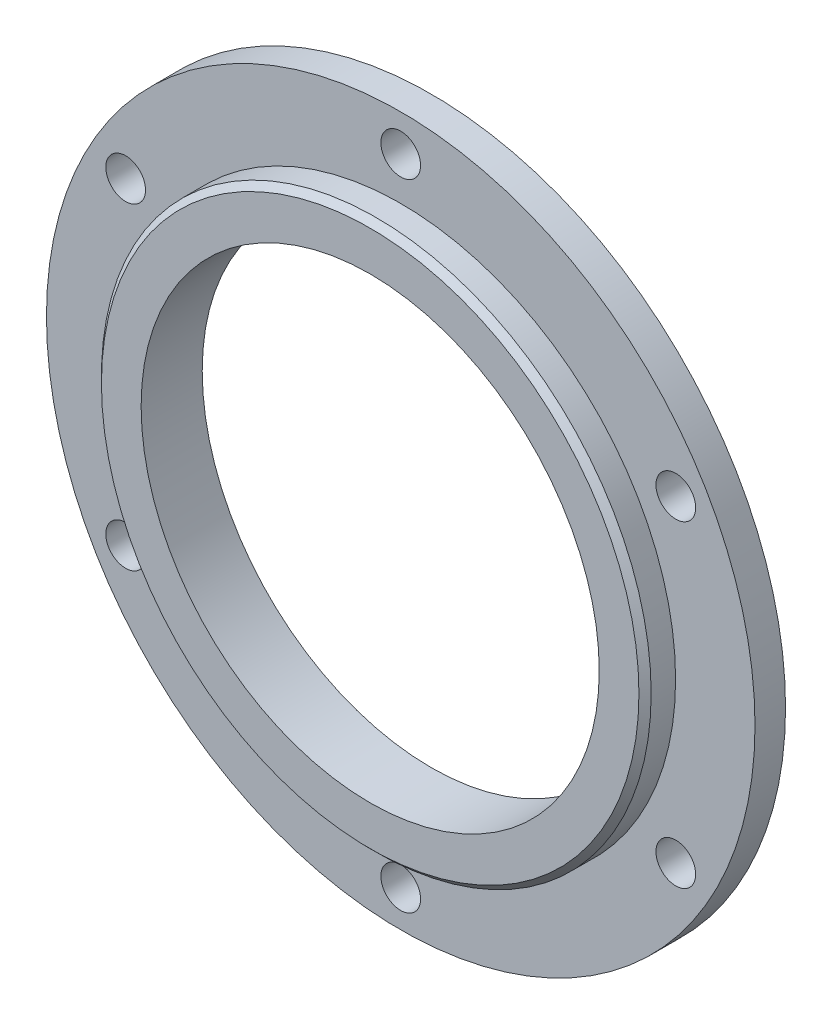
ISO-10303-21;
HEADER;
FILE_DESCRIPTION(('STEP AP214'),'2;1');
FILE_NAME('part.step','',(''),(''),'','','');
FILE_SCHEMA(('AUTOMOTIVE_DESIGN { 1 0 10303 214 1 1 1 1 }'));
ENDSEC;
DATA;
#1=APPLICATION_CONTEXT('core data for automotive mechanical design processes');
#2=APPLICATION_PROTOCOL_DEFINITION('international standard','automotive_design',2000,#1);
#3=PRODUCT_CONTEXT('',#1,'mechanical');
#4=PRODUCT('Part','Part','',(#3));
#5=PRODUCT_RELATED_PRODUCT_CATEGORY('part','',(#4));
#6=PRODUCT_DEFINITION_FORMATION('','',#4);
#7=PRODUCT_DEFINITION_CONTEXT('part definition',#1,'design');
#8=PRODUCT_DEFINITION('design','',#6,#7);
#9=PRODUCT_DEFINITION_SHAPE('','',#8);
#10=(LENGTH_UNIT() NAMED_UNIT(*) SI_UNIT(.MILLI.,.METRE.));
#11=(NAMED_UNIT(*) PLANE_ANGLE_UNIT() SI_UNIT($,.RADIAN.));
#12=(NAMED_UNIT(*) SI_UNIT($,.STERADIAN.) SOLID_ANGLE_UNIT());
#13=UNCERTAINTY_MEASURE_WITH_UNIT(LENGTH_MEASURE(1.E-05),#10,'distance_accuracy_value','');
#14=(GEOMETRIC_REPRESENTATION_CONTEXT(3) GLOBAL_UNCERTAINTY_ASSIGNED_CONTEXT((#13)) GLOBAL_UNIT_ASSIGNED_CONTEXT((#10,
#11,#12)) REPRESENTATION_CONTEXT('',''));
#15=CARTESIAN_POINT('',(0.,0.,0.));
#16=DIRECTION('',(0.,0.,1.));
#17=DIRECTION('',(1.,0.,0.));
#18=AXIS2_PLACEMENT_3D('',#15,#16,#17);
#19=CARTESIAN_POINT('',(0.,45.,-5.));
#20=DIRECTION('',(0.,0.,-1.));
#21=DIRECTION('',(-1.,0.,0.));
#22=AXIS2_PLACEMENT_3D('',#19,#20,#21);
#23=PLANE('',#22);
#24=CARTESIAN_POINT('',(-45.0333209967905,26.0000000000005,-5.));
#25=DIRECTION('',(0.,0.,1.));
#26=DIRECTION('',(1.,0.,0.));
#27=AXIS2_PLACEMENT_3D('',#24,#25,#26);
#28=CIRCLE('',#27,3.25);
#29=CARTESIAN_POINT('',(-41.7833209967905,26.0000000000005,-5.));
#30=VERTEX_POINT('',#29);
#31=EDGE_CURVE('E75',#30,#30,#28,.T.);
#32=ORIENTED_EDGE('',*,*,#31,.F.);
#33=EDGE_LOOP('',(#32));
#34=FACE_BOUND('',#33,.T.);
#35=CARTESIAN_POINT('',(-45.0333209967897,-26.0000000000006,-5.));
#36=DIRECTION('',(0.,0.,1.));
#37=DIRECTION('',(1.,0.,0.));
#38=AXIS2_PLACEMENT_3D('',#35,#36,#37);
#39=CIRCLE('',#38,3.2500000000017);
#40=CARTESIAN_POINT('',(-41.783320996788,-26.0000000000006,-5.));
#41=VERTEX_POINT('',#40);
#42=EDGE_CURVE('E65',#41,#41,#39,.T.);
#43=ORIENTED_EDGE('',*,*,#42,.F.);
#44=EDGE_LOOP('',(#43));
#45=FACE_BOUND('',#44,.T.);
#46=CARTESIAN_POINT('',(1.47114159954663E-12,-52.,-5.));
#47=DIRECTION('',(0.,0.,1.));
#48=DIRECTION('',(1.,0.,0.));
#49=AXIS2_PLACEMENT_3D('',#46,#47,#48);
#50=CIRCLE('',#49,3.25000000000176);
#51=CARTESIAN_POINT('',(3.25000000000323,-52.,-5.));
#52=VERTEX_POINT('',#51);
#53=EDGE_CURVE('E62',#52,#52,#50,.T.);
#54=ORIENTED_EDGE('',*,*,#53,.F.);
#55=EDGE_LOOP('',(#54));
#56=FACE_BOUND('',#55,.T.);
#57=CARTESIAN_POINT('',(45.0333209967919,-25.9999999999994,-5.));
#58=DIRECTION('',(0.,0.,1.));
#59=DIRECTION('',(1.,0.,0.));
#60=AXIS2_PLACEMENT_3D('',#57,#58,#59);
#61=CIRCLE('',#60,3.25000000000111);
#62=CARTESIAN_POINT('',(48.283320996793,-25.9999999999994,-5.));
#63=VERTEX_POINT('',#62);
#64=EDGE_CURVE('E59',#63,#63,#61,.T.);
#65=ORIENTED_EDGE('',*,*,#64,.F.);
#66=EDGE_LOOP('',(#65));
#67=FACE_BOUND('',#66,.T.);
#68=CARTESIAN_POINT('',(45.0333209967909,25.9999999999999,-5.));
#69=DIRECTION('',(0.,0.,1.));
#70=DIRECTION('',(1.,0.,0.));
#71=AXIS2_PLACEMENT_3D('',#68,#69,#70);
#72=CIRCLE('',#71,3.25);
#73=CARTESIAN_POINT('',(48.2833209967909,25.9999999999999,-5.));
#74=VERTEX_POINT('',#73);
#75=EDGE_CURVE('E55',#74,#74,#72,.T.);
#76=ORIENTED_EDGE('',*,*,#75,.F.);
#77=EDGE_LOOP('',(#76));
#78=FACE_BOUND('',#77,.T.);
#79=CARTESIAN_POINT('',(0.,52.,-5.));
#80=DIRECTION('',(0.,0.,1.));
#81=DIRECTION('',(1.,0.,0.));
#82=AXIS2_PLACEMENT_3D('',#79,#80,#81);
#83=CIRCLE('',#82,3.25);
#84=CARTESIAN_POINT('',(3.25,52.,-5.));
#85=VERTEX_POINT('',#84);
#86=EDGE_CURVE('E51',#85,#85,#83,.T.);
#87=ORIENTED_EDGE('',*,*,#86,.F.);
#88=EDGE_LOOP('',(#87));
#89=FACE_BOUND('',#88,.T.);
#90=CARTESIAN_POINT('',(0.,0.,-5.));
#91=DIRECTION('',(0.,0.,1.));
#92=DIRECTION('',(1.,0.,0.));
#93=AXIS2_PLACEMENT_3D('',#90,#91,#92);
#94=CIRCLE('',#93,45.);
#95=CARTESIAN_POINT('',(45.,0.,-5.));
#96=VERTEX_POINT('',#95);
#97=EDGE_CURVE('E50',#96,#96,#94,.T.);
#98=ORIENTED_EDGE('',*,*,#97,.F.);
#99=EDGE_LOOP('',(#98));
#100=FACE_BOUND('',#99,.T.);
#101=CARTESIAN_POINT('',(0.,0.,-5.));
#102=DIRECTION('',(0.,0.,1.));
#103=DIRECTION('',(1.,0.,0.));
#104=AXIS2_PLACEMENT_3D('',#101,#102,#103);
#105=CIRCLE('',#104,58.);
#106=CARTESIAN_POINT('',(58.,0.,-5.));
#107=VERTEX_POINT('',#106);
#108=EDGE_CURVE('E10',#107,#107,#105,.T.);
#109=ORIENTED_EDGE('',*,*,#108,.T.);
#110=EDGE_LOOP('',(#109));
#111=FACE_BOUND('',#110,.T.);
#112=ADVANCED_FACE('F31',(#34,#45,#56,#67,#78,#89,#100,#111),#23,.F.);
#113=CARTESIAN_POINT('',(0.,0.,0.));
#114=DIRECTION('',(0.,0.,1.));
#115=DIRECTION('',(1.,0.,0.));
#116=AXIS2_PLACEMENT_3D('',#113,#114,#115);
#117=CYLINDRICAL_SURFACE('',#116,58.);
#118=ORIENTED_EDGE('',*,*,#108,.F.);
#119=EDGE_LOOP('',(#118));
#120=FACE_BOUND('',#119,.T.);
#121=CARTESIAN_POINT('',(0.,0.,-10.));
#122=DIRECTION('',(0.,0.,1.));
#123=DIRECTION('',(1.,0.,0.));
#124=AXIS2_PLACEMENT_3D('',#121,#122,#123);
#125=CIRCLE('',#124,58.);
#126=CARTESIAN_POINT('',(58.,0.,-10.));
#127=VERTEX_POINT('',#126);
#128=EDGE_CURVE('E38',#127,#127,#125,.T.);
#129=ORIENTED_EDGE('',*,*,#128,.T.);
#130=EDGE_LOOP('',(#129));
#131=FACE_BOUND('',#130,.T.);
#132=ADVANCED_FACE('F125',(#120,#131),#117,.T.);
#133=CARTESIAN_POINT('',(0.,58.,-10.));
#134=DIRECTION('',(0.,0.,1.));
#135=DIRECTION('',(1.,0.,0.));
#136=AXIS2_PLACEMENT_3D('',#133,#134,#135);
#137=PLANE('',#136);
#138=CARTESIAN_POINT('',(-45.0333209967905,26.0000000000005,-10.));
#139=DIRECTION('',(0.,0.,1.));
#140=DIRECTION('',(1.,0.,0.));
#141=AXIS2_PLACEMENT_3D('',#138,#139,#140);
#142=CIRCLE('',#141,3.25);
#143=CARTESIAN_POINT('',(-41.7833209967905,26.0000000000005,-10.));
#144=VERTEX_POINT('',#143);
#145=EDGE_CURVE('E34',#144,#144,#142,.T.);
#146=ORIENTED_EDGE('',*,*,#145,.T.);
#147=EDGE_LOOP('',(#146));
#148=FACE_BOUND('',#147,.T.);
#149=CARTESIAN_POINT('',(-45.0333209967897,-26.0000000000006,-10.));
#150=DIRECTION('',(0.,0.,1.));
#151=DIRECTION('',(1.,0.,0.));
#152=AXIS2_PLACEMENT_3D('',#149,#150,#151);
#153=CIRCLE('',#152,3.2500000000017);
#154=CARTESIAN_POINT('',(-41.783320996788,-26.0000000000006,-10.));
#155=VERTEX_POINT('',#154);
#156=EDGE_CURVE('E63',#155,#155,#153,.T.);
#157=ORIENTED_EDGE('',*,*,#156,.T.);
#158=EDGE_LOOP('',(#157));
#159=FACE_BOUND('',#158,.T.);
#160=CARTESIAN_POINT('',(1.47114159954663E-12,-52.,-10.));
#161=DIRECTION('',(0.,0.,1.));
#162=DIRECTION('',(1.,0.,0.));
#163=AXIS2_PLACEMENT_3D('',#160,#161,#162);
#164=CIRCLE('',#163,3.25000000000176);
#165=CARTESIAN_POINT('',(3.25000000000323,-52.,-10.));
#166=VERTEX_POINT('',#165);
#167=EDGE_CURVE('E60',#166,#166,#164,.T.);
#168=ORIENTED_EDGE('',*,*,#167,.T.);
#169=EDGE_LOOP('',(#168));
#170=FACE_BOUND('',#169,.T.);
#171=CARTESIAN_POINT('',(45.0333209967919,-25.9999999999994,-10.));
#172=DIRECTION('',(0.,0.,1.));
#173=DIRECTION('',(1.,0.,0.));
#174=AXIS2_PLACEMENT_3D('',#171,#172,#173);
#175=CIRCLE('',#174,3.25000000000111);
#176=CARTESIAN_POINT('',(48.283320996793,-25.9999999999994,-10.));
#177=VERTEX_POINT('',#176);
#178=EDGE_CURVE('E56',#177,#177,#175,.T.);
#179=ORIENTED_EDGE('',*,*,#178,.T.);
#180=EDGE_LOOP('',(#179));
#181=FACE_BOUND('',#180,.T.);
#182=CARTESIAN_POINT('',(45.0333209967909,25.9999999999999,-10.));
#183=DIRECTION('',(0.,0.,1.));
#184=DIRECTION('',(1.,0.,0.));
#185=AXIS2_PLACEMENT_3D('',#182,#183,#184);
#186=CIRCLE('',#185,3.25);
#187=CARTESIAN_POINT('',(48.2833209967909,25.9999999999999,-10.));
#188=VERTEX_POINT('',#187);
#189=EDGE_CURVE('E52',#188,#188,#186,.T.);
#190=ORIENTED_EDGE('',*,*,#189,.T.);
#191=EDGE_LOOP('',(#190));
#192=FACE_BOUND('',#191,.T.);
#193=CARTESIAN_POINT('',(0.,52.,-10.));
#194=DIRECTION('',(0.,0.,1.));
#195=DIRECTION('',(1.,0.,0.));
#196=AXIS2_PLACEMENT_3D('',#193,#194,#195);
#197=CIRCLE('',#196,3.25);
#198=CARTESIAN_POINT('',(3.25,52.,-10.));
#199=VERTEX_POINT('',#198);
#200=EDGE_CURVE('E47',#199,#199,#197,.T.);
#201=ORIENTED_EDGE('',*,*,#200,.T.);
#202=EDGE_LOOP('',(#201));
#203=FACE_BOUND('',#202,.T.);
#204=ORIENTED_EDGE('',*,*,#128,.F.);
#205=EDGE_LOOP('',(#204));
#206=FACE_BOUND('',#205,.T.);
#207=CARTESIAN_POINT('',(0.,0.,-10.));
#208=DIRECTION('',(0.,0.,1.));
#209=DIRECTION('',(1.,0.,0.));
#210=AXIS2_PLACEMENT_3D('',#207,#208,#209);
#211=CIRCLE('',#210,37.5);
#212=CARTESIAN_POINT('',(37.5,0.,-10.));
#213=VERTEX_POINT('',#212);
#214=EDGE_CURVE('E43',#213,#213,#211,.T.);
#215=ORIENTED_EDGE('',*,*,#214,.T.);
#216=EDGE_LOOP('',(#215));
#217=FACE_BOUND('',#216,.T.);
#218=ADVANCED_FACE('F97',(#148,#159,#170,#181,#192,#203,#206,#217),#137,.F.);
#219=CARTESIAN_POINT('',(0.,0.,0.));
#220=DIRECTION('',(0.,0.,1.));
#221=DIRECTION('',(1.,0.,0.));
#222=AXIS2_PLACEMENT_3D('',#219,#220,#221);
#223=CYLINDRICAL_SURFACE('',#222,37.5);
#224=ORIENTED_EDGE('',*,*,#214,.F.);
#225=EDGE_LOOP('',(#224));
#226=FACE_BOUND('',#225,.T.);
#227=CARTESIAN_POINT('',(0.,0.,0.));
#228=DIRECTION('',(0.,0.,1.));
#229=DIRECTION('',(1.,0.,0.));
#230=AXIS2_PLACEMENT_3D('',#227,#228,#229);
#231=CIRCLE('',#230,37.5);
#232=CARTESIAN_POINT('',(37.5,0.,0.));
#233=VERTEX_POINT('',#232);
#234=EDGE_CURVE('E92',#233,#233,#231,.T.);
#235=ORIENTED_EDGE('',*,*,#234,.T.);
#236=EDGE_LOOP('',(#235));
#237=FACE_BOUND('',#236,.T.);
#238=ADVANCED_FACE('F99',(#226,#237),#223,.F.);
#239=CARTESIAN_POINT('',(0.,37.5,0.));
#240=DIRECTION('',(0.,0.,-1.));
#241=DIRECTION('',(-1.,0.,0.));
#242=AXIS2_PLACEMENT_3D('',#239,#240,#241);
#243=PLANE('',#242);
#244=ORIENTED_EDGE('',*,*,#234,.F.);
#245=EDGE_LOOP('',(#244));
#246=FACE_BOUND('',#245,.T.);
#247=CARTESIAN_POINT('',(0.,0.,0.));
#248=DIRECTION('',(0.,0.,1.));
#249=DIRECTION('',(1.,0.,0.));
#250=AXIS2_PLACEMENT_3D('',#247,#248,#249);
#251=CIRCLE('',#250,44.);
#252=CARTESIAN_POINT('',(44.,0.,0.));
#253=VERTEX_POINT('',#252);
#254=EDGE_CURVE('E89',#253,#253,#251,.T.);
#255=ORIENTED_EDGE('',*,*,#254,.T.);
#256=EDGE_LOOP('',(#255));
#257=FACE_BOUND('',#256,.T.);
#258=ADVANCED_FACE('F102',(#246,#257),#243,.F.);
#259=CARTESIAN_POINT('',(0.,0.,-0.999999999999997));
#260=DIRECTION('',(0.,0.,-1.));
#261=DIRECTION('',(-1.,0.,0.));
#262=AXIS2_PLACEMENT_3D('',#259,#260,#261);
#263=CONICAL_SURFACE('',#262,45.,0.78539816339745);
#264=ORIENTED_EDGE('',*,*,#254,.F.);
#265=EDGE_LOOP('',(#264));
#266=FACE_BOUND('',#265,.T.);
#267=CARTESIAN_POINT('',(0.,0.,-0.999999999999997));
#268=DIRECTION('',(0.,0.,1.));
#269=DIRECTION('',(1.,0.,0.));
#270=AXIS2_PLACEMENT_3D('',#267,#268,#269);
#271=CIRCLE('',#270,45.);
#272=CARTESIAN_POINT('',(45.,0.,-0.999999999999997));
#273=VERTEX_POINT('',#272);
#274=EDGE_CURVE('E86',#273,#273,#271,.T.);
#275=ORIENTED_EDGE('',*,*,#274,.T.);
#276=EDGE_LOOP('',(#275));
#277=FACE_BOUND('',#276,.T.);
#278=ADVANCED_FACE('F108',(#266,#277),#263,.T.);
#279=CARTESIAN_POINT('',(0.,0.,0.));
#280=DIRECTION('',(0.,0.,1.));
#281=DIRECTION('',(1.,0.,0.));
#282=AXIS2_PLACEMENT_3D('',#279,#280,#281);
#283=CYLINDRICAL_SURFACE('',#282,45.);
#284=ORIENTED_EDGE('',*,*,#274,.F.);
#285=EDGE_LOOP('',(#284));
#286=FACE_BOUND('',#285,.T.);
#287=ORIENTED_EDGE('',*,*,#97,.T.);
#288=EDGE_LOOP('',(#287));
#289=FACE_BOUND('',#288,.T.);
#290=ADVANCED_FACE('F114',(#286,#289),#283,.T.);
#291=CARTESIAN_POINT('',(0.,52.,-15.));
#292=DIRECTION('',(0.,0.,1.));
#293=DIRECTION('',(1.,0.,0.));
#294=AXIS2_PLACEMENT_3D('',#291,#292,#293);
#295=CYLINDRICAL_SURFACE('',#294,3.25);
#296=ORIENTED_EDGE('',*,*,#86,.T.);
#297=EDGE_LOOP('',(#296));
#298=FACE_BOUND('',#297,.T.);
#299=ORIENTED_EDGE('',*,*,#200,.F.);
#300=EDGE_LOOP('',(#299));
#301=FACE_BOUND('',#300,.T.);
#302=ADVANCED_FACE('F120',(#298,#301),#295,.F.);
#303=CARTESIAN_POINT('',(45.0333209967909,25.9999999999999,-15.));
#304=DIRECTION('',(0.,0.,1.));
#305=DIRECTION('',(1.,0.,0.));
#306=AXIS2_PLACEMENT_3D('',#303,#304,#305);
#307=CYLINDRICAL_SURFACE('',#306,3.25);
#308=ORIENTED_EDGE('',*,*,#75,.T.);
#309=EDGE_LOOP('',(#308));
#310=FACE_BOUND('',#309,.T.);
#311=ORIENTED_EDGE('',*,*,#189,.F.);
#312=EDGE_LOOP('',(#311));
#313=FACE_BOUND('',#312,.T.);
#314=ADVANCED_FACE('F145',(#310,#313),#307,.F.);
#315=CARTESIAN_POINT('',(45.0333209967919,-25.9999999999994,-15.));
#316=DIRECTION('',(0.,0.,1.));
#317=DIRECTION('',(1.,0.,0.));
#318=AXIS2_PLACEMENT_3D('',#315,#316,#317);
#319=CYLINDRICAL_SURFACE('',#318,3.25000000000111);
#320=ORIENTED_EDGE('',*,*,#64,.T.);
#321=EDGE_LOOP('',(#320));
#322=FACE_BOUND('',#321,.T.);
#323=ORIENTED_EDGE('',*,*,#178,.F.);
#324=EDGE_LOOP('',(#323));
#325=FACE_BOUND('',#324,.T.);
#326=ADVANCED_FACE('F160',(#322,#325),#319,.F.);
#327=CARTESIAN_POINT('',(1.47114159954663E-12,-52.,-15.));
#328=DIRECTION('',(0.,0.,1.));
#329=DIRECTION('',(1.,0.,0.));
#330=AXIS2_PLACEMENT_3D('',#327,#328,#329);
#331=CYLINDRICAL_SURFACE('',#330,3.25000000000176);
#332=ORIENTED_EDGE('',*,*,#53,.T.);
#333=EDGE_LOOP('',(#332));
#334=FACE_BOUND('',#333,.T.);
#335=ORIENTED_EDGE('',*,*,#167,.F.);
#336=EDGE_LOOP('',(#335));
#337=FACE_BOUND('',#336,.T.);
#338=ADVANCED_FACE('F164',(#334,#337),#331,.F.);
#339=CARTESIAN_POINT('',(-45.0333209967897,-26.0000000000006,-15.));
#340=DIRECTION('',(0.,0.,1.));
#341=DIRECTION('',(1.,0.,0.));
#342=AXIS2_PLACEMENT_3D('',#339,#340,#341);
#343=CYLINDRICAL_SURFACE('',#342,3.2500000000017);
#344=ORIENTED_EDGE('',*,*,#42,.T.);
#345=EDGE_LOOP('',(#344));
#346=FACE_BOUND('',#345,.T.);
#347=ORIENTED_EDGE('',*,*,#156,.F.);
#348=EDGE_LOOP('',(#347));
#349=FACE_BOUND('',#348,.T.);
#350=ADVANCED_FACE('F168',(#346,#349),#343,.F.);
#351=CARTESIAN_POINT('',(-45.0333209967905,26.0000000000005,-15.));
#352=DIRECTION('',(0.,0.,1.));
#353=DIRECTION('',(1.,0.,0.));
#354=AXIS2_PLACEMENT_3D('',#351,#352,#353);
#355=CYLINDRICAL_SURFACE('',#354,3.25);
#356=ORIENTED_EDGE('',*,*,#31,.T.);
#357=EDGE_LOOP('',(#356));
#358=FACE_BOUND('',#357,.T.);
#359=ORIENTED_EDGE('',*,*,#145,.F.);
#360=EDGE_LOOP('',(#359));
#361=FACE_BOUND('',#360,.T.);
#362=ADVANCED_FACE('F172',(#358,#361),#355,.F.);
#363=CLOSED_SHELL('',(#112,#132,#218,#238,#258,#278,#290,#302,#314,#326,#338,#350,#362));
#364=MANIFOLD_SOLID_BREP('B2',#363);
#365=ADVANCED_BREP_SHAPE_REPRESENTATION('',(#18,#364),#14);
#366=SHAPE_DEFINITION_REPRESENTATION(#9,#365);
ENDSEC;
END-ISO-10303-21;
